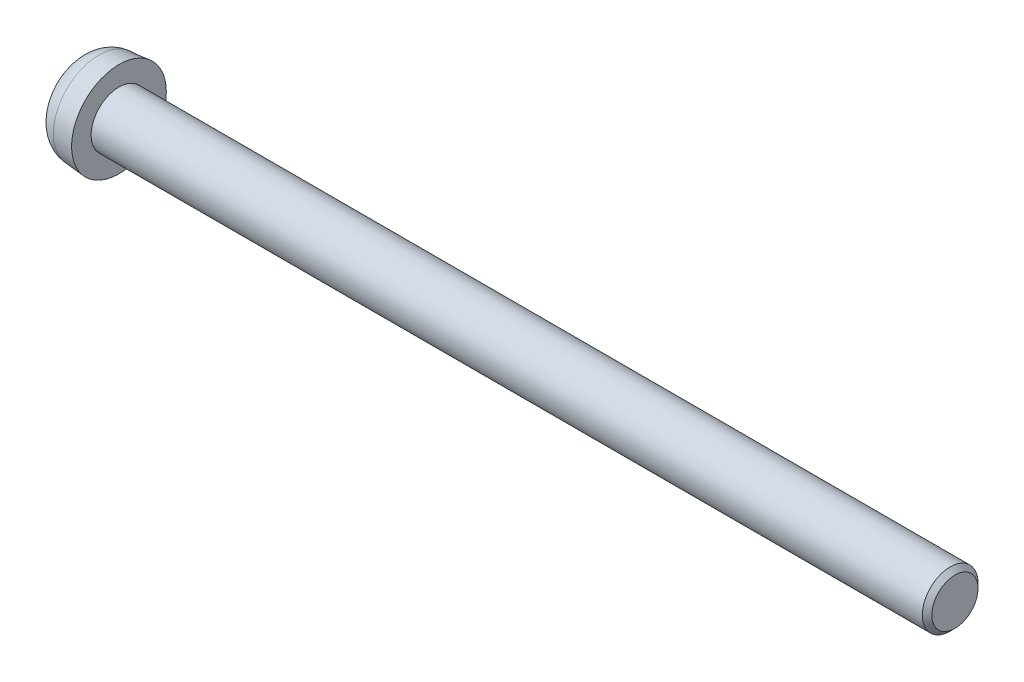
ISO-10303-21;
HEADER;
FILE_DESCRIPTION(('STEP AP214'),'2;1');
FILE_NAME('part.step','',(''),(''),'','','');
FILE_SCHEMA(('AUTOMOTIVE_DESIGN { 1 0 10303 214 1 1 1 1 }'));
ENDSEC;
DATA;
#1=APPLICATION_CONTEXT('core data for automotive mechanical design processes');
#2=APPLICATION_PROTOCOL_DEFINITION('international standard','automotive_design',2000,#1);
#3=PRODUCT_CONTEXT('',#1,'mechanical');
#4=PRODUCT('Part','Part','',(#3));
#5=PRODUCT_RELATED_PRODUCT_CATEGORY('part','',(#4));
#6=PRODUCT_DEFINITION_FORMATION('','',#4);
#7=PRODUCT_DEFINITION_CONTEXT('part definition',#1,'design');
#8=PRODUCT_DEFINITION('design','',#6,#7);
#9=PRODUCT_DEFINITION_SHAPE('','',#8);
#10=(LENGTH_UNIT() NAMED_UNIT(*) SI_UNIT(.MILLI.,.METRE.));
#11=(NAMED_UNIT(*) PLANE_ANGLE_UNIT() SI_UNIT($,.RADIAN.));
#12=(NAMED_UNIT(*) SI_UNIT($,.STERADIAN.) SOLID_ANGLE_UNIT());
#13=UNCERTAINTY_MEASURE_WITH_UNIT(LENGTH_MEASURE(1.E-05),#10,'distance_accuracy_value','');
#14=(GEOMETRIC_REPRESENTATION_CONTEXT(3) GLOBAL_UNCERTAINTY_ASSIGNED_CONTEXT((#13)) GLOBAL_UNIT_ASSIGNED_CONTEXT((#10,
#11,#12)) REPRESENTATION_CONTEXT('',''));
#15=CARTESIAN_POINT('',(0.,0.,0.));
#16=DIRECTION('',(0.,0.,1.));
#17=DIRECTION('',(1.,0.,0.));
#18=AXIS2_PLACEMENT_3D('',#15,#16,#17);
#19=CARTESIAN_POINT('',(-1.397478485,0.,-1.120322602));
#20=CARTESIAN_POINT('',(-1.397478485,2.240645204,-1.120322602));
#21=CARTESIAN_POINT('',(-1.397478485,2.240645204,1.120322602));
#22=CARTESIAN_POINT('',(-1.397478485,0.,1.120322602));
#23=CARTESIAN_POINT('',(-1.492603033,0.,-0.865812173));
#24=CARTESIAN_POINT('',(-1.492603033,1.731624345,-0.865812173));
#25=CARTESIAN_POINT('',(-1.492603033,1.731624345,0.865812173));
#26=CARTESIAN_POINT('',(-1.492603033,0.,0.865812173));
#27=CARTESIAN_POINT('',(-1.554720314,0.,-0.601301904));
#28=CARTESIAN_POINT('',(-1.554720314,1.202603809,-0.601301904));
#29=CARTESIAN_POINT('',(-1.554720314,1.202603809,0.601301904));
#30=CARTESIAN_POINT('',(-1.554720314,0.,0.601301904));
#31=CARTESIAN_POINT('',(-1.582829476,0.,-0.33105366));
#32=CARTESIAN_POINT('',(-1.582829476,0.66210732,-0.33105366));
#33=CARTESIAN_POINT('',(-1.582829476,0.66210732,0.33105366));
#34=CARTESIAN_POINT('',(-1.582829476,0.,0.33105366));
#35=(BOUNDED_SURFACE() B_SPLINE_SURFACE(3,3,((#19,#20,#21,#22),(#23,#24,#25,#26),(#27,#28,#29,
#30),(#31,#32,#33,#34)),.UNSPECIFIED.,.F.,.F.,.F.) B_SPLINE_SURFACE_WITH_KNOTS((4,4),(4,4),(0.,
1.),(0.,1.),.UNSPECIFIED.) GEOMETRIC_REPRESENTATION_ITEM() RATIONAL_B_SPLINE_SURFACE(((1.,
0.333333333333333,0.333333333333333,1.),(0.994629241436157,0.331543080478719,0.331543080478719,
0.994629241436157),(0.994629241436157,0.331543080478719,0.331543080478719,0.994629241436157),
(1.,0.333333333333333,0.333333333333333,1.))) REPRESENTATION_ITEM('') SURFACE());
#36=CARTESIAN_POINT('',(-1.58232422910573,0.2375,0.237499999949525));
#37=CARTESIAN_POINT('',(-1.5732844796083,0.2375,0.35803764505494));
#38=CARTESIAN_POINT('',(-1.55756227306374,0.2375,0.477303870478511));
#39=CARTESIAN_POINT('',(-1.512459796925,0.2375,0.714837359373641));
#40=CARTESIAN_POINT('',(-1.48290351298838,0.2375,0.833071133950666));
#41=CARTESIAN_POINT('',(-1.44648875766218,0.2375,0.949999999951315));
#42=B_SPLINE_CURVE_WITH_KNOTS('',3,(#36,#37,#38,#39,#40,#41),.UNSPECIFIED.,.F.,.F.,(4,2,4),(0.,
0.360894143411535,0.726510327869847),.UNSPECIFIED.);
#43=CARTESIAN_POINT('',(-1.58232422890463,0.2375,0.237499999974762));
#44=VERTEX_POINT('',#43);
#45=CARTESIAN_POINT('',(-1.44648875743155,0.23750000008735,0.95));
#46=VERTEX_POINT('',#45);
#47=EDGE_CURVE('E343',#44,#46,#42,.T.);
#48=CARTESIAN_POINT('',(-1.44648875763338,0.2375000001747,0.95));
#49=CARTESIAN_POINT('',(-1.44956936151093,0.197976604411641,0.950000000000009));
#50=CARTESIAN_POINT('',(-1.45187996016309,0.158423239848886,0.950000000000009));
#51=CARTESIAN_POINT('',(-1.45496114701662,0.0792565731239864,0.949999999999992));
#52=CARTESIAN_POINT('',(-1.45573173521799,0.0396432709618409,0.949999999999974));
#53=CARTESIAN_POINT('',(-1.45573231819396,0.,0.949999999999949));
#54=B_SPLINE_CURVE_WITH_KNOTS('',3,(#48,#49,#50,#51,#52,#53),.UNSPECIFIED.,.F.,.F.,(4,2,4),(0.,
0.118862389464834,0.237724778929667),.UNSPECIFIED.);
#55=CARTESIAN_POINT('',(-1.4557323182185,0.,0.949999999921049));
#56=VERTEX_POINT('',#55);
#57=EDGE_CURVE('E252',#46,#56,#54,.T.);
#58=CARTESIAN_POINT('',(-1.397478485,0.,1.120322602));
#59=CARTESIAN_POINT('',(-1.492603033,0.,0.865812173));
#60=CARTESIAN_POINT('',(-1.554720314,0.,0.601301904));
#61=CARTESIAN_POINT('',(-1.582829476,0.,0.33105366));
#62=(BOUNDED_CURVE() B_SPLINE_CURVE(3,(#58,#59,#60,#61),.UNSPECIFIED.,.F.,
.F.) B_SPLINE_CURVE_WITH_KNOTS((4,4),(0.,1.),
.UNSPECIFIED.) CURVE() GEOMETRIC_REPRESENTATION_ITEM() RATIONAL_B_SPLINE_CURVE((1.,
0.994629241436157,0.994629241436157,1.)) REPRESENTATION_ITEM(''));
#63=CARTESIAN_POINT('',(-1.39747848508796,0.,1.12032260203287));
#64=VERTEX_POINT('',#63);
#65=EDGE_CURVE('E154',#56,#64,#62,.F.);
#66=CARTESIAN_POINT('',(-1.397478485,0.,0.));
#67=DIRECTION('',(1.,0.,0.));
#68=DIRECTION('',(0.,0.,-1.));
#69=AXIS2_PLACEMENT_3D('',#66,#67,#68);
#70=CIRCLE('',#69,1.120322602);
#71=CARTESIAN_POINT('',(-1.39747848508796,0.,-1.12032260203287));
#72=VERTEX_POINT('',#71);
#73=EDGE_CURVE('E249',#72,#64,#70,.T.);
#74=CARTESIAN_POINT('',(-1.397478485,0.,-1.120322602));
#75=CARTESIAN_POINT('',(-1.492603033,0.,-0.865812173));
#76=CARTESIAN_POINT('',(-1.554720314,0.,-0.601301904));
#77=CARTESIAN_POINT('',(-1.582829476,0.,-0.33105366));
#78=(BOUNDED_CURVE() B_SPLINE_CURVE(3,(#74,#75,#76,#77),.UNSPECIFIED.,.F.,
.F.) B_SPLINE_CURVE_WITH_KNOTS((4,4),(0.,1.),
.UNSPECIFIED.) CURVE() GEOMETRIC_REPRESENTATION_ITEM() RATIONAL_B_SPLINE_CURVE((1.,
0.994629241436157,0.994629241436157,1.)) REPRESENTATION_ITEM(''));
#79=CARTESIAN_POINT('',(-1.45573231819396,0.,-0.95));
#80=VERTEX_POINT('',#79);
#81=EDGE_CURVE('E153',#72,#80,#78,.T.);
#82=CARTESIAN_POINT('',(-1.45573231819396,0.,-0.95));
#83=CARTESIAN_POINT('',(-1.45573173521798,0.0396432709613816,-0.950000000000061));
#84=CARTESIAN_POINT('',(-1.45496114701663,0.0792565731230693,-0.950000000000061));
#85=CARTESIAN_POINT('',(-1.45187996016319,0.158423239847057,-0.94999999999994));
#86=CARTESIAN_POINT('',(-1.4495693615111,0.197976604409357,-0.949999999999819));
#87=CARTESIAN_POINT('',(-1.44648875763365,0.237500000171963,-0.949999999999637));
#88=B_SPLINE_CURVE_WITH_KNOTS('',3,(#82,#83,#84,#85,#86,#87),.UNSPECIFIED.,.F.,.F.,(4,2,4),(0.,
0.118862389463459,0.237724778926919),.UNSPECIFIED.);
#89=CARTESIAN_POINT('',(-1.44648875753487,0.2375,-0.949999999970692));
#90=VERTEX_POINT('',#89);
#91=EDGE_CURVE('E21',#80,#90,#88,.T.);
#92=CARTESIAN_POINT('',(-1.44648875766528,0.2375,-0.949999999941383));
#93=CARTESIAN_POINT('',(-1.48243130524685,0.2375,-0.834591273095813));
#94=CARTESIAN_POINT('',(-1.51169233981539,0.2375,-0.717906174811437));
#95=CARTESIAN_POINT('',(-1.55714681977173,0.2375,-0.480439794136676));
#96=CARTESIAN_POINT('',(-1.57316427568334,0.2375,-0.359624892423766));
#97=CARTESIAN_POINT('',(-1.58232422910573,0.2375,-0.237499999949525));
#98=B_SPLINE_CURVE_WITH_KNOTS('',3,(#92,#93,#94,#95,#96,#97),.UNSPECIFIED.,.F.,.F.,(4,2,4),(0.,
0.360894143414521,0.726510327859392),.UNSPECIFIED.);
#99=CARTESIAN_POINT('',(-1.58232422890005,0.237500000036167,-0.2375));
#100=VERTEX_POINT('',#99);
#101=EDGE_CURVE('E133',#90,#100,#98,.T.);
#102=CARTESIAN_POINT('',(-1.58232422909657,0.237500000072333,-0.2375));
#103=CARTESIAN_POINT('',(-1.5732844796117,0.358037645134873,-0.237500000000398));
#104=CARTESIAN_POINT('',(-1.55756227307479,0.477303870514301,-0.237500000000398));
#105=CARTESIAN_POINT('',(-1.51245979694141,0.714837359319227,-0.237499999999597));
#106=CARTESIAN_POINT('',(-1.48290351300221,0.83307113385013,-0.237499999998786));
#107=CARTESIAN_POINT('',(-1.44648875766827,0.949999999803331,-0.237499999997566));
#108=B_SPLINE_CURVE_WITH_KNOTS('',3,(#102,#103,#104,#105,#106,#107),.UNSPECIFIED.,.F.,.F.,(4,2,
4),(0.,0.360894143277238,0.726510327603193),.UNSPECIFIED.);
#109=CARTESIAN_POINT('',(-1.44648875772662,0.95,-0.237500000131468));
#110=VERTEX_POINT('',#109);
#111=EDGE_CURVE('E142',#100,#110,#108,.T.);
#112=CARTESIAN_POINT('',(-1.44648875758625,0.95,-0.237500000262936));
#113=CARTESIAN_POINT('',(-1.45265113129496,0.95,-0.158333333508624));
#114=CARTESIAN_POINT('',(-1.45573231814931,0.95,-0.0791666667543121));
#115=CARTESIAN_POINT('',(-1.45573231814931,0.95,0.079166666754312));
#116=CARTESIAN_POINT('',(-1.45265113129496,0.95,0.158333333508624));
#117=CARTESIAN_POINT('',(-1.44648875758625,0.95,0.237500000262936));
#118=B_SPLINE_CURVE_WITH_KNOTS('',3,(#112,#113,#114,#115,#116,#117),.UNSPECIFIED.,.F.,.F.,(4,2,
4),(0.,0.237679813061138,0.475359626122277),.UNSPECIFIED.);
#119=CARTESIAN_POINT('',(-1.4464887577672,0.949999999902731,0.2375));
#120=VERTEX_POINT('',#119);
#121=EDGE_CURVE('E344',#110,#120,#118,.T.);
#122=CARTESIAN_POINT('',(-1.44648875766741,0.949999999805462,0.2375));
#123=CARTESIAN_POINT('',(-1.48243130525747,0.83459127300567,0.2375));
#124=CARTESIAN_POINT('',(-1.51169233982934,0.717906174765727,0.2375));
#125=CARTESIAN_POINT('',(-1.55714681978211,0.480439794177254,0.2375));
#126=CARTESIAN_POINT('',(-1.57316427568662,0.359624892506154,0.2375));
#127=CARTESIAN_POINT('',(-1.58232422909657,0.237500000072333,0.2375));
#128=B_SPLINE_CURVE_WITH_KNOTS('',3,(#122,#123,#124,#125,#126,#127),.UNSPECIFIED.,.F.,.F.,(4,2,
4),(0.,0.360894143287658,0.726510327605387),.UNSPECIFIED.);
#129=EDGE_CURVE('E336',#120,#44,#128,.T.);
#130=ORIENTED_EDGE('',*,*,#47,.T.);
#131=ORIENTED_EDGE('',*,*,#57,.T.);
#132=ORIENTED_EDGE('',*,*,#65,.T.);
#133=ORIENTED_EDGE('',*,*,#73,.F.);
#134=ORIENTED_EDGE('',*,*,#81,.T.);
#135=ORIENTED_EDGE('',*,*,#91,.T.);
#136=ORIENTED_EDGE('',*,*,#101,.T.);
#137=ORIENTED_EDGE('',*,*,#111,.T.);
#138=ORIENTED_EDGE('',*,*,#121,.T.);
#139=ORIENTED_EDGE('',*,*,#129,.T.);
#140=EDGE_LOOP('',(#130,#131,#132,#133,#134,#135,#136,#137,#138,#139));
#141=FACE_BOUND('',#140,.T.);
#142=ADVANCED_FACE('F17',(#141),#35,.T.);
#143=CARTESIAN_POINT('',(30.,-0.83996,0.83996));
#144=DIRECTION('',(1.,0.,0.));
#145=DIRECTION('',(0.,0.,-1.));
#146=AXIS2_PLACEMENT_3D('',#143,#144,#145);
#147=PLANE('',#146);
#148=CARTESIAN_POINT('',(30.,0.,0.));
#149=DIRECTION('',(-1.,0.,0.));
#150=DIRECTION('',(0.,-1.,0.));
#151=AXIS2_PLACEMENT_3D('',#148,#149,#150);
#152=CIRCLE('',#151,0.829999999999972);
#153=CARTESIAN_POINT('',(30.,-0.829999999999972,0.));
#154=VERTEX_POINT('',#153);
#155=EDGE_CURVE('E243',#154,#154,#152,.F.);
#156=ORIENTED_EDGE('',*,*,#155,.T.);
#157=EDGE_LOOP('',(#156));
#158=FACE_BOUND('',#157,.T.);
#159=ADVANCED_FACE('F277',(#158),#147,.T.);
#160=CARTESIAN_POINT('',(30.,0.,0.));
#161=DIRECTION('',(-1.,0.,0.));
#162=DIRECTION('',(0.,-1.,0.));
#163=AXIS2_PLACEMENT_3D('',#160,#161,#162);
#164=CONICAL_SURFACE('',#163,0.83,0.785398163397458);
#165=CARTESIAN_POINT('',(29.83,0.,0.));
#166=DIRECTION('',(-1.,0.,0.));
#167=DIRECTION('',(0.,0.,1.));
#168=AXIS2_PLACEMENT_3D('',#165,#166,#167);
#169=CIRCLE('',#168,1.);
#170=CARTESIAN_POINT('',(29.83,0.,1.));
#171=VERTEX_POINT('',#170);
#172=EDGE_CURVE('E240',#171,#171,#169,.F.);
#173=ORIENTED_EDGE('',*,*,#172,.T.);
#174=EDGE_LOOP('',(#173));
#175=FACE_BOUND('',#174,.T.);
#176=ORIENTED_EDGE('',*,*,#155,.F.);
#177=EDGE_LOOP('',(#176));
#178=FACE_BOUND('',#177,.T.);
#179=ADVANCED_FACE('F360',(#175,#178),#164,.T.);
#180=CARTESIAN_POINT('',(29.83,0.,0.));
#181=DIRECTION('',(-1.,0.,0.));
#182=DIRECTION('',(0.,0.,1.));
#183=AXIS2_PLACEMENT_3D('',#180,#181,#182);
#184=CYLINDRICAL_SURFACE('',#183,1.);
#185=CARTESIAN_POINT('',(0.,0.,0.));
#186=DIRECTION('',(-1.,0.,0.));
#187=DIRECTION('',(0.,0.,1.));
#188=AXIS2_PLACEMENT_3D('',#185,#186,#187);
#189=CIRCLE('',#188,1.);
#190=CARTESIAN_POINT('',(0.,0.,1.));
#191=VERTEX_POINT('',#190);
#192=EDGE_CURVE('E220',#191,#191,#189,.T.);
#193=ORIENTED_EDGE('',*,*,#192,.F.);
#194=EDGE_LOOP('',(#193));
#195=FACE_BOUND('',#194,.T.);
#196=ORIENTED_EDGE('',*,*,#172,.F.);
#197=EDGE_LOOP('',(#196));
#198=FACE_BOUND('',#197,.T.);
#199=ADVANCED_FACE('F450',(#195,#198),#184,.T.);
#200=CARTESIAN_POINT('',(-0.8,-0.2375,0.95));
#201=DIRECTION('',(0.79535595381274,0.,0.606142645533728));
#202=DIRECTION('',(0.606142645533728,0.,-0.79535595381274));
#203=AXIS2_PLACEMENT_3D('',#200,#201,#202);
#204=PLANE('',#203);
#205=DIRECTION('',(0.,-1.,0.));
#206=VECTOR('',#205,1.);
#207=CARTESIAN_POINT('',(-0.257002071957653,0.,0.2375));
#208=LINE('',#207,#206);
#209=CARTESIAN_POINT('',(-0.257002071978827,0.2375,0.2375));
#210=VERTEX_POINT('',#209);
#211=CARTESIAN_POINT('',(-0.25700207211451,-0.2375,0.2375));
#212=VERTEX_POINT('',#211);
#213=EDGE_CURVE('E183',#210,#212,#208,.T.);
#214=ORIENTED_EDGE('',*,*,#213,.T.);
#215=DIRECTION('',(0.606142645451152,0.,-0.795355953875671));
#216=VECTOR('',#215,1.);
#217=CARTESIAN_POINT('',(-0.80000000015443,-0.2375,0.95));
#218=LINE('',#217,#216);
#219=CARTESIAN_POINT('',(-0.800000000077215,-0.2375,0.95));
#220=VERTEX_POINT('',#219);
#221=EDGE_CURVE('E178',#220,#212,#218,.T.);
#222=ORIENTED_EDGE('',*,*,#221,.F.);
#223=DIRECTION('',(0.,1.,0.));
#224=VECTOR('',#223,1.);
#225=CARTESIAN_POINT('',(-0.8,0.,0.95));
#226=LINE('',#225,#224);
#227=CARTESIAN_POINT('',(-0.8,0.2375,0.95));
#228=VERTEX_POINT('',#227);
#229=EDGE_CURVE('E179',#220,#228,#226,.T.);
#230=ORIENTED_EDGE('',*,*,#229,.T.);
#231=DIRECTION('',(0.606142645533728,0.,-0.79535595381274));
#232=VECTOR('',#231,1.);
#233=CARTESIAN_POINT('',(-0.8,0.2375,0.95));
#234=LINE('',#233,#232);
#235=EDGE_CURVE('E147',#228,#210,#234,.T.);
#236=ORIENTED_EDGE('',*,*,#235,.T.);
#237=EDGE_LOOP('',(#214,#222,#230,#236));
#238=FACE_BOUND('',#237,.T.);
#239=ADVANCED_FACE('F456',(#238),#204,.F.);
#240=CARTESIAN_POINT('',(-1.590276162,0.2375,0.2375));
#241=DIRECTION('',(0.,1.,0.));
#242=DIRECTION('',(0.,0.,1.));
#243=AXIS2_PLACEMENT_3D('',#240,#241,#242);
#244=PLANE('',#243);
#245=ORIENTED_EDGE('',*,*,#47,.F.);
#246=DIRECTION('',(1.,0.,0.));
#247=VECTOR('',#246,1.);
#248=CARTESIAN_POINT('',(-0.9209131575,0.2375,0.2375));
#249=LINE('',#248,#247);
#250=EDGE_CURVE('E184',#44,#210,#249,.T.);
#251=ORIENTED_EDGE('',*,*,#250,.T.);
#252=ORIENTED_EDGE('',*,*,#235,.F.);
#253=DIRECTION('',(-1.,0.,0.));
#254=VECTOR('',#253,1.);
#255=CARTESIAN_POINT('',(-1.129833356,0.2375,0.95));
#256=LINE('',#255,#254);
#257=EDGE_CURVE('E175',#228,#46,#256,.T.);
#258=ORIENTED_EDGE('',*,*,#257,.T.);
#259=EDGE_LOOP('',(#245,#251,#252,#258));
#260=FACE_BOUND('',#259,.T.);
#261=ADVANCED_FACE('F387',(#260),#244,.F.);
#262=CARTESIAN_POINT('',(-1.590276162,0.2375,-0.95));
#263=DIRECTION('',(0.,1.,0.));
#264=DIRECTION('',(0.,0.,1.));
#265=AXIS2_PLACEMENT_3D('',#262,#263,#264);
#266=PLANE('',#265);
#267=DIRECTION('',(0.606142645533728,0.,0.79535595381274));
#268=VECTOR('',#267,1.);
#269=CARTESIAN_POINT('',(-0.528501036,0.2375,-0.59375));
#270=LINE('',#269,#268);
#271=CARTESIAN_POINT('',(-0.800000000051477,0.2375,-0.95));
#272=VERTEX_POINT('',#271);
#273=CARTESIAN_POINT('',(-0.257002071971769,0.2375,-0.2375));
#274=VERTEX_POINT('',#273);
#275=EDGE_CURVE('E218',#272,#274,#270,.T.);
#276=ORIENTED_EDGE('',*,*,#275,.T.);
#277=DIRECTION('',(1.,0.,0.));
#278=VECTOR('',#277,1.);
#279=CARTESIAN_POINT('',(-0.9209131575,0.2375,-0.2375));
#280=LINE('',#279,#278);
#281=EDGE_CURVE('E139',#100,#274,#280,.T.);
#282=ORIENTED_EDGE('',*,*,#281,.F.);
#283=ORIENTED_EDGE('',*,*,#101,.F.);
#284=DIRECTION('',(-1.,0.,0.));
#285=VECTOR('',#284,1.);
#286=CARTESIAN_POINT('',(-0.9196631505,0.2375,-0.95));
#287=LINE('',#286,#285);
#288=EDGE_CURVE('E136',#272,#90,#287,.T.);
#289=ORIENTED_EDGE('',*,*,#288,.F.);
#290=EDGE_LOOP('',(#276,#282,#283,#289));
#291=FACE_BOUND('',#290,.T.);
#292=ADVANCED_FACE('F135',(#291),#266,.F.);
#293=CARTESIAN_POINT('',(-0.8,-0.95,-0.2375));
#294=DIRECTION('',(0.792405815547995,-0.609994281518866,0.));
#295=DIRECTION('',(0.609994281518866,0.792405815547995,0.));
#296=AXIS2_PLACEMENT_3D('',#293,#294,#295);
#297=PLANE('',#296);
#298=DIRECTION('',(0.,0.,-1.));
#299=VECTOR('',#298,1.);
#300=CARTESIAN_POINT('',(-0.251517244,-0.2375,0.));
#301=LINE('',#300,#299);
#302=CARTESIAN_POINT('',(-0.251517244,-0.2375,0.2375));
#303=VERTEX_POINT('',#302);
#304=CARTESIAN_POINT('',(-0.251517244,-0.2375,-0.2375));
#305=VERTEX_POINT('',#304);
#306=EDGE_CURVE('E146',#303,#305,#301,.T.);
#307=ORIENTED_EDGE('',*,*,#306,.T.);
#308=DIRECTION('',(0.609994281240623,0.792405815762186,0.));
#309=VECTOR('',#308,1.);
#310=CARTESIAN_POINT('',(-0.799999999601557,-0.95,-0.2375));
#311=LINE('',#310,#309);
#312=CARTESIAN_POINT('',(-0.799999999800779,-0.95,-0.2375));
#313=VERTEX_POINT('',#312);
#314=EDGE_CURVE('E205',#313,#305,#311,.T.);
#315=ORIENTED_EDGE('',*,*,#314,.F.);
#316=DIRECTION('',(0.,0.,1.));
#317=VECTOR('',#316,1.);
#318=CARTESIAN_POINT('',(-0.8,-0.95,0.));
#319=LINE('',#318,#317);
#320=CARTESIAN_POINT('',(-0.8,-0.95,0.2375));
#321=VERTEX_POINT('',#320);
#322=EDGE_CURVE('E196',#313,#321,#319,.T.);
#323=ORIENTED_EDGE('',*,*,#322,.T.);
#324=DIRECTION('',(0.609994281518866,0.792405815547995,0.));
#325=VECTOR('',#324,1.);
#326=CARTESIAN_POINT('',(-0.8,-0.95,0.2375));
#327=LINE('',#326,#325);
#328=EDGE_CURVE('E194',#321,#303,#327,.T.);
#329=ORIENTED_EDGE('',*,*,#328,.T.);
#330=EDGE_LOOP('',(#307,#315,#323,#329));
#331=FACE_BOUND('',#330,.T.);
#332=ADVANCED_FACE('F386',(#331),#297,.F.);
#333=CARTESIAN_POINT('',(-0.251517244,-0.2375,0.2375));
#334=DIRECTION('',(1.,0.,0.));
#335=DIRECTION('',(0.,0.,-1.));
#336=AXIS2_PLACEMENT_3D('',#333,#334,#335);
#337=PLANE('',#336);
#338=DIRECTION('',(0.,0.,-1.));
#339=VECTOR('',#338,1.);
#340=CARTESIAN_POINT('',(-0.251517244,0.2375,0.));
#341=LINE('',#340,#339);
#342=CARTESIAN_POINT('',(-0.251517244,0.2375,0.2375));
#343=VERTEX_POINT('',#342);
#344=CARTESIAN_POINT('',(-0.251517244,0.2375,-0.2375));
#345=VERTEX_POINT('',#344);
#346=EDGE_CURVE('E228',#343,#345,#341,.T.);
#347=ORIENTED_EDGE('',*,*,#346,.T.);
#348=DIRECTION('',(0.,1.,0.));
#349=VECTOR('',#348,1.);
#350=CARTESIAN_POINT('',(-0.251517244,0.,-0.2375));
#351=LINE('',#350,#349);
#352=EDGE_CURVE('E230',#305,#345,#351,.T.);
#353=ORIENTED_EDGE('',*,*,#352,.F.);
#354=ORIENTED_EDGE('',*,*,#306,.F.);
#355=DIRECTION('',(0.,1.,0.));
#356=VECTOR('',#355,1.);
#357=CARTESIAN_POINT('',(-0.251517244,0.,0.2375));
#358=LINE('',#357,#356);
#359=EDGE_CURVE('E237',#303,#343,#358,.T.);
#360=ORIENTED_EDGE('',*,*,#359,.T.);
#361=EDGE_LOOP('',(#347,#353,#354,#360));
#362=FACE_BOUND('',#361,.T.);
#363=ADVANCED_FACE('F391',(#362),#337,.F.);
#364=CARTESIAN_POINT('',(-0.251517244,0.2375,-0.2375));
#365=DIRECTION('',(0.792405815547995,0.609994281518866,0.));
#366=DIRECTION('',(-0.609994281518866,0.792405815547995,0.));
#367=AXIS2_PLACEMENT_3D('',#364,#365,#366);
#368=PLANE('',#367);
#369=DIRECTION('',(0.,0.,-1.));
#370=VECTOR('',#369,1.);
#371=CARTESIAN_POINT('',(-0.8,0.95,0.));
#372=LINE('',#371,#370);
#373=CARTESIAN_POINT('',(-0.8,0.95,0.2375));
#374=VERTEX_POINT('',#373);
#375=CARTESIAN_POINT('',(-0.799999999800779,0.95,-0.2375));
#376=VERTEX_POINT('',#375);
#377=EDGE_CURVE('E221',#374,#376,#372,.T.);
#378=ORIENTED_EDGE('',*,*,#377,.T.);
#379=DIRECTION('',(-0.609994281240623,0.792405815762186,0.));
#380=VECTOR('',#379,1.);
#381=CARTESIAN_POINT('',(-0.251517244,0.2375,-0.2375));
#382=LINE('',#381,#380);
#383=EDGE_CURVE('E201',#345,#376,#382,.T.);
#384=ORIENTED_EDGE('',*,*,#383,.F.);
#385=ORIENTED_EDGE('',*,*,#346,.F.);
#386=DIRECTION('',(-0.609994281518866,0.792405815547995,0.));
#387=VECTOR('',#386,1.);
#388=CARTESIAN_POINT('',(-0.251517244,0.2375,0.2375));
#389=LINE('',#388,#387);
#390=EDGE_CURVE('E191',#343,#374,#389,.T.);
#391=ORIENTED_EDGE('',*,*,#390,.T.);
#392=EDGE_LOOP('',(#378,#384,#385,#391));
#393=FACE_BOUND('',#392,.T.);
#394=ADVANCED_FACE('F395',(#393),#368,.F.);
#395=CARTESIAN_POINT('',(-1.459666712,0.95,-0.2375));
#396=DIRECTION('',(0.,1.,0.));
#397=DIRECTION('',(0.,0.,1.));
#398=AXIS2_PLACEMENT_3D('',#395,#396,#397);
#399=PLANE('',#398);
#400=DIRECTION('',(-1.,0.,0.));
#401=VECTOR('',#400,1.);
#402=CARTESIAN_POINT('',(-0.9209131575,0.95,0.2375));
#403=LINE('',#402,#401);
#404=EDGE_CURVE('E188',#374,#120,#403,.T.);
#405=ORIENTED_EDGE('',*,*,#404,.T.);
#406=ORIENTED_EDGE('',*,*,#121,.F.);
#407=DIRECTION('',(-1.,0.,0.));
#408=VECTOR('',#407,1.);
#409=CARTESIAN_POINT('',(-0.9209131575,0.95,-0.2375));
#410=LINE('',#409,#408);
#411=EDGE_CURVE('E197',#376,#110,#410,.T.);
#412=ORIENTED_EDGE('',*,*,#411,.F.);
#413=ORIENTED_EDGE('',*,*,#377,.F.);
#414=EDGE_LOOP('',(#405,#406,#412,#413));
#415=FACE_BOUND('',#414,.T.);
#416=ADVANCED_FACE('F398',(#415),#399,.F.);
#417=CARTESIAN_POINT('',(-0.257002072,-0.2375,-0.2375));
#418=DIRECTION('',(0.79535595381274,0.,-0.606142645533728));
#419=DIRECTION('',(-0.606142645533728,0.,-0.79535595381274));
#420=AXIS2_PLACEMENT_3D('',#417,#418,#419);
#421=PLANE('',#420);
#422=DIRECTION('',(0.,-1.,0.));
#423=VECTOR('',#422,1.);
#424=CARTESIAN_POINT('',(-0.8,0.,-0.95));
#425=LINE('',#424,#423);
#426=CARTESIAN_POINT('',(-0.800000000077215,-0.2375,-0.95));
#427=VERTEX_POINT('',#426);
#428=EDGE_CURVE('E145',#272,#427,#425,.T.);
#429=ORIENTED_EDGE('',*,*,#428,.T.);
#430=DIRECTION('',(-0.606142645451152,0.,-0.795355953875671));
#431=VECTOR('',#430,1.);
#432=CARTESIAN_POINT('',(-0.257002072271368,-0.2375,-0.2375));
#433=LINE('',#432,#431);
#434=CARTESIAN_POINT('',(-0.257002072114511,-0.2375,-0.2375));
#435=VERTEX_POINT('',#434);
#436=EDGE_CURVE('E212',#435,#427,#433,.T.);
#437=ORIENTED_EDGE('',*,*,#436,.F.);
#438=DIRECTION('',(0.,-1.,0.));
#439=VECTOR('',#438,1.);
#440=CARTESIAN_POINT('',(-0.257002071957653,0.,-0.2375));
#441=LINE('',#440,#439);
#442=EDGE_CURVE('E206',#274,#435,#441,.T.);
#443=ORIENTED_EDGE('',*,*,#442,.F.);
#444=ORIENTED_EDGE('',*,*,#275,.F.);
#445=EDGE_LOOP('',(#429,#437,#443,#444));
#446=FACE_BOUND('',#445,.T.);
#447=ADVANCED_FACE('F403',(#446),#421,.F.);
#448=CARTESIAN_POINT('',(0.,-1.7204,1.7204));
#449=DIRECTION('',(1.,0.,0.));
#450=DIRECTION('',(0.,0.,-1.));
#451=AXIS2_PLACEMENT_3D('',#448,#449,#450);
#452=PLANE('',#451);
#453=ORIENTED_EDGE('',*,*,#192,.T.);
#454=EDGE_LOOP('',(#453));
#455=FACE_BOUND('',#454,.T.);
#456=CARTESIAN_POINT('',(0.,0.,0.));
#457=DIRECTION('',(1.,0.,0.));
#458=DIRECTION('',(0.,0.,-1.));
#459=AXIS2_PLACEMENT_3D('',#456,#457,#458);
#460=CIRCLE('',#459,1.7);
#461=CARTESIAN_POINT('',(0.,0.,-1.7));
#462=VERTEX_POINT('',#461);
#463=EDGE_CURVE('E214',#462,#462,#460,.T.);
#464=ORIENTED_EDGE('',*,*,#463,.T.);
#465=EDGE_LOOP('',(#464));
#466=FACE_BOUND('',#465,.T.);
#467=ADVANCED_FACE('F406',(#455,#466),#452,.T.);
#468=CARTESIAN_POINT('',(-1.459666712,-0.2375,0.95));
#469=DIRECTION('',(0.,0.,1.));
#470=DIRECTION('',(1.,0.,0.));
#471=AXIS2_PLACEMENT_3D('',#468,#469,#470);
#472=PLANE('',#471);
#473=ORIENTED_EDGE('',*,*,#257,.F.);
#474=ORIENTED_EDGE('',*,*,#229,.F.);
#475=DIRECTION('',(1.,0.,0.));
#476=VECTOR('',#475,1.);
#477=CARTESIAN_POINT('',(-0.9196631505,-0.2375,0.95));
#478=LINE('',#477,#476);
#479=CARTESIAN_POINT('',(-1.44648875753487,-0.2375,0.949999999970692));
#480=VERTEX_POINT('',#479);
#481=EDGE_CURVE('E180',#480,#220,#478,.T.);
#482=ORIENTED_EDGE('',*,*,#481,.F.);
#483=CARTESIAN_POINT('',(-1.45573231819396,0.,0.95));
#484=CARTESIAN_POINT('',(-1.45573173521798,-0.0396432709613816,0.95000000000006));
#485=CARTESIAN_POINT('',(-1.45496114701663,-0.0792565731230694,0.95000000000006));
#486=CARTESIAN_POINT('',(-1.45187996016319,-0.158423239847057,0.94999999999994));
#487=CARTESIAN_POINT('',(-1.4495693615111,-0.197976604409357,0.949999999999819));
#488=CARTESIAN_POINT('',(-1.44648875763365,-0.237500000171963,0.949999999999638));
#489=B_SPLINE_CURVE_WITH_KNOTS('',3,(#483,#484,#485,#486,#487,#488),.UNSPECIFIED.,.F.,.F.,(4,2,
4),(0.,0.118862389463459,0.237724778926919),.UNSPECIFIED.);
#490=EDGE_CURVE('E315',#56,#480,#489,.T.);
#491=ORIENTED_EDGE('',*,*,#490,.F.);
#492=ORIENTED_EDGE('',*,*,#57,.F.);
#493=EDGE_LOOP('',(#473,#474,#482,#491,#492));
#494=FACE_BOUND('',#493,.T.);
#495=ADVANCED_FACE('F325',(#494),#472,.F.);
#496=CARTESIAN_POINT('',(-1.590276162,-0.2375,0.2375));
#497=DIRECTION('',(0.,1.,0.));
#498=DIRECTION('',(0.,0.,1.));
#499=AXIS2_PLACEMENT_3D('',#496,#497,#498);
#500=PLANE('',#499);
#501=CARTESIAN_POINT('',(-1.44648875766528,-0.2375,0.949999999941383));
#502=CARTESIAN_POINT('',(-1.48243130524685,-0.2375,0.834591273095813));
#503=CARTESIAN_POINT('',(-1.51169233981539,-0.2375,0.717906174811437));
#504=CARTESIAN_POINT('',(-1.55714681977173,-0.2375,0.480439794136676));
#505=CARTESIAN_POINT('',(-1.57316427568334,-0.2375,0.359624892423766));
#506=CARTESIAN_POINT('',(-1.58232422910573,-0.2375,0.237499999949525));
#507=B_SPLINE_CURVE_WITH_KNOTS('',3,(#501,#502,#503,#504,#505,#506),.UNSPECIFIED.,.F.,.F.,(4,2,
4),(0.,0.360894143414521,0.726510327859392),.UNSPECIFIED.);
#508=CARTESIAN_POINT('',(-1.58232422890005,-0.237500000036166,0.2375));
#509=VERTEX_POINT('',#508);
#510=EDGE_CURVE('E309',#480,#509,#507,.T.);
#511=ORIENTED_EDGE('',*,*,#510,.F.);
#512=ORIENTED_EDGE('',*,*,#481,.T.);
#513=ORIENTED_EDGE('',*,*,#221,.T.);
#514=DIRECTION('',(-1.,0.,0.));
#515=VECTOR('',#514,1.);
#516=CARTESIAN_POINT('',(-0.9209131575,-0.2375,0.2375));
#517=LINE('',#516,#515);
#518=EDGE_CURVE('E192',#212,#509,#517,.T.);
#519=ORIENTED_EDGE('',*,*,#518,.T.);
#520=EDGE_LOOP('',(#511,#512,#513,#519));
#521=FACE_BOUND('',#520,.T.);
#522=ADVANCED_FACE('F321',(#521),#500,.T.);
#523=CARTESIAN_POINT('',(-1.590309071,-0.95,0.2375));
#524=DIRECTION('',(0.,0.,1.));
#525=DIRECTION('',(1.,0.,0.));
#526=AXIS2_PLACEMENT_3D('',#523,#524,#525);
#527=PLANE('',#526);
#528=ORIENTED_EDGE('',*,*,#129,.F.);
#529=ORIENTED_EDGE('',*,*,#404,.F.);
#530=ORIENTED_EDGE('',*,*,#390,.F.);
#531=ORIENTED_EDGE('',*,*,#359,.F.);
#532=ORIENTED_EDGE('',*,*,#328,.F.);
#533=DIRECTION('',(-1.,0.,0.));
#534=VECTOR('',#533,1.);
#535=CARTESIAN_POINT('',(-1.129833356,-0.95,0.2375));
#536=LINE('',#535,#534);
#537=CARTESIAN_POINT('',(-1.4464887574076,-0.95,0.237500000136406));
#538=VERTEX_POINT('',#537);
#539=EDGE_CURVE('E187',#321,#538,#536,.T.);
#540=ORIENTED_EDGE('',*,*,#539,.T.);
#541=CARTESIAN_POINT('',(-1.58232422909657,-0.237500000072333,0.2375));
#542=CARTESIAN_POINT('',(-1.57328447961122,-0.358037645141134,0.237500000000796));
#543=CARTESIAN_POINT('',(-1.55756227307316,-0.477303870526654,0.237500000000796));
#544=CARTESIAN_POINT('',(-1.51245979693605,-0.714837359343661,0.237499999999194));
#545=CARTESIAN_POINT('',(-1.48290351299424,-0.833071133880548,0.237499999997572));
#546=CARTESIAN_POINT('',(-1.44648875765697,-0.949999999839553,0.237499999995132));
#547=B_SPLINE_CURVE_WITH_KNOTS('',3,(#541,#542,#543,#544,#545,#546),.UNSPECIFIED.,.F.,.F.,(4,2,
4),(0.,0.360894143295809,0.726510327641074),.UNSPECIFIED.);
#548=EDGE_CURVE('E303',#509,#538,#547,.T.);
#549=ORIENTED_EDGE('',*,*,#548,.F.);
#550=ORIENTED_EDGE('',*,*,#518,.F.);
#551=ORIENTED_EDGE('',*,*,#213,.F.);
#552=ORIENTED_EDGE('',*,*,#250,.F.);
#553=EDGE_LOOP('',(#528,#529,#530,#531,#532,#540,#549,#550,#551,#552));
#554=FACE_BOUND('',#553,.T.);
#555=ADVANCED_FACE('F324',(#554),#527,.F.);
#556=CARTESIAN_POINT('',(-1.459666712,-0.95,0.2375));
#557=DIRECTION('',(0.,-1.,0.));
#558=DIRECTION('',(0.,0.,-1.));
#559=AXIS2_PLACEMENT_3D('',#556,#557,#558);
#560=PLANE('',#559);
#561=DIRECTION('',(1.,0.,0.));
#562=VECTOR('',#561,1.);
#563=CARTESIAN_POINT('',(-0.9209131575,-0.95,-0.2375));
#564=LINE('',#563,#562);
#565=CARTESIAN_POINT('',(-1.4464887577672,-0.949999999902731,-0.2375));
#566=VERTEX_POINT('',#565);
#567=EDGE_CURVE('E202',#566,#313,#564,.T.);
#568=ORIENTED_EDGE('',*,*,#567,.F.);
#569=CARTESIAN_POINT('',(-1.44648875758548,-0.95,0.237500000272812));
#570=CARTESIAN_POINT('',(-1.45265113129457,-0.95,0.158333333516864));
#571=CARTESIAN_POINT('',(-1.45573231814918,-0.95,0.079166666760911));
#572=CARTESIAN_POINT('',(-1.45573231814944,-0.95,-0.079166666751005));
#573=CARTESIAN_POINT('',(-1.45265113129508,-0.95,-0.158333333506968));
#574=CARTESIAN_POINT('',(-1.44648875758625,-0.95,-0.237500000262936));
#575=B_SPLINE_CURVE_WITH_KNOTS('',3,(#569,#570,#571,#572,#573,#574),.UNSPECIFIED.,.F.,.F.,(4,2,
4),(0.,0.237679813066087,0.475359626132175),.UNSPECIFIED.);
#576=EDGE_CURVE('E297',#538,#566,#575,.T.);
#577=ORIENTED_EDGE('',*,*,#576,.F.);
#578=ORIENTED_EDGE('',*,*,#539,.F.);
#579=ORIENTED_EDGE('',*,*,#322,.F.);
#580=EDGE_LOOP('',(#568,#577,#578,#579));
#581=FACE_BOUND('',#580,.T.);
#582=ADVANCED_FACE('F331',(#581),#560,.F.);
#583=CARTESIAN_POINT('',(-1.590309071,-0.95,-0.2375));
#584=DIRECTION('',(0.,0.,1.));
#585=DIRECTION('',(1.,0.,0.));
#586=AXIS2_PLACEMENT_3D('',#583,#584,#585);
#587=PLANE('',#586);
#588=ORIENTED_EDGE('',*,*,#383,.T.);
#589=ORIENTED_EDGE('',*,*,#411,.T.);
#590=ORIENTED_EDGE('',*,*,#111,.F.);
#591=ORIENTED_EDGE('',*,*,#281,.T.);
#592=ORIENTED_EDGE('',*,*,#442,.T.);
#593=DIRECTION('',(1.,0.,0.));
#594=VECTOR('',#593,1.);
#595=CARTESIAN_POINT('',(-0.9196631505,-0.2375,-0.2375));
#596=LINE('',#595,#594);
#597=CARTESIAN_POINT('',(-1.5823242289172,-0.2375,-0.237499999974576));
#598=VERTEX_POINT('',#597);
#599=EDGE_CURVE('E200',#598,#435,#596,.T.);
#600=ORIENTED_EDGE('',*,*,#599,.F.);
#601=CARTESIAN_POINT('',(-1.44648875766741,-0.949999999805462,-0.2375));
#602=CARTESIAN_POINT('',(-1.48243130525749,-0.834591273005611,-0.2375));
#603=CARTESIAN_POINT('',(-1.51169233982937,-0.717906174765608,-0.2375));
#604=CARTESIAN_POINT('',(-1.55714681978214,-0.480439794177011,-0.2375));
#605=CARTESIAN_POINT('',(-1.57316427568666,-0.359624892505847,-0.2375));
#606=CARTESIAN_POINT('',(-1.58232422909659,-0.23750000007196,-0.2375));
#607=B_SPLINE_CURVE_WITH_KNOTS('',3,(#601,#602,#603,#604,#605,#606),.UNSPECIFIED.,.F.,.F.,(4,2,
4),(0.,0.360894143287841,0.72651032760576),.UNSPECIFIED.);
#608=EDGE_CURVE('E290',#566,#598,#607,.T.);
#609=ORIENTED_EDGE('',*,*,#608,.F.);
#610=ORIENTED_EDGE('',*,*,#567,.T.);
#611=ORIENTED_EDGE('',*,*,#314,.T.);
#612=ORIENTED_EDGE('',*,*,#352,.T.);
#613=EDGE_LOOP('',(#588,#589,#590,#591,#592,#600,#609,#610,#611,#612));
#614=FACE_BOUND('',#613,.T.);
#615=ADVANCED_FACE('F488',(#614),#587,.T.);
#616=CARTESIAN_POINT('',(-1.590276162,-0.2375,-0.95));
#617=DIRECTION('',(0.,1.,0.));
#618=DIRECTION('',(0.,0.,1.));
#619=AXIS2_PLACEMENT_3D('',#616,#617,#618);
#620=PLANE('',#619);
#621=ORIENTED_EDGE('',*,*,#436,.T.);
#622=DIRECTION('',(-1.,0.,0.));
#623=VECTOR('',#622,1.);
#624=CARTESIAN_POINT('',(-1.129833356,-0.2375,-0.95));
#625=LINE('',#624,#623);
#626=CARTESIAN_POINT('',(-1.44648875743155,-0.23750000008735,-0.95));
#627=VERTEX_POINT('',#626);
#628=EDGE_CURVE('E40',#427,#627,#625,.T.);
#629=ORIENTED_EDGE('',*,*,#628,.T.);
#630=CARTESIAN_POINT('',(-1.58232422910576,-0.2375,-0.237499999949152));
#631=CARTESIAN_POINT('',(-1.57328447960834,-0.2375,-0.35803764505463));
#632=CARTESIAN_POINT('',(-1.55756227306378,-0.2375,-0.477303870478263));
#633=CARTESIAN_POINT('',(-1.51245979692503,-0.2375,-0.714837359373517));
#634=CARTESIAN_POINT('',(-1.4829035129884,-0.2375,-0.833071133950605));
#635=CARTESIAN_POINT('',(-1.44648875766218,-0.2375,-0.949999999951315));
#636=B_SPLINE_CURVE_WITH_KNOTS('',3,(#630,#631,#632,#633,#634,#635),.UNSPECIFIED.,.F.,.F.,(4,2,
4),(0.,0.360894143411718,0.72651032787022),.UNSPECIFIED.);
#637=EDGE_CURVE('E260',#598,#627,#636,.T.);
#638=ORIENTED_EDGE('',*,*,#637,.F.);
#639=ORIENTED_EDGE('',*,*,#599,.T.);
#640=EDGE_LOOP('',(#621,#629,#638,#639));
#641=FACE_BOUND('',#640,.T.);
#642=ADVANCED_FACE('F495',(#641),#620,.T.);
#643=CARTESIAN_POINT('',(-0.8,-0.2375,-0.95));
#644=DIRECTION('',(0.,0.,-1.));
#645=DIRECTION('',(-1.,0.,0.));
#646=AXIS2_PLACEMENT_3D('',#643,#644,#645);
#647=PLANE('',#646);
#648=ORIENTED_EDGE('',*,*,#628,.F.);
#649=ORIENTED_EDGE('',*,*,#428,.F.);
#650=ORIENTED_EDGE('',*,*,#288,.T.);
#651=ORIENTED_EDGE('',*,*,#91,.F.);
#652=CARTESIAN_POINT('',(-1.44648875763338,-0.2375000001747,-0.95));
#653=CARTESIAN_POINT('',(-1.44956936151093,-0.197976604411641,-0.950000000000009));
#654=CARTESIAN_POINT('',(-1.45187996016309,-0.158423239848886,-0.950000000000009));
#655=CARTESIAN_POINT('',(-1.45496114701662,-0.0792565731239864,-0.949999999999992));
#656=CARTESIAN_POINT('',(-1.45573173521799,-0.0396432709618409,-0.949999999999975));
#657=CARTESIAN_POINT('',(-1.45573231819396,0.,-0.949999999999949));
#658=B_SPLINE_CURVE_WITH_KNOTS('',3,(#652,#653,#654,#655,#656,#657),.UNSPECIFIED.,.F.,.F.,(4,2,
4),(0.,0.118862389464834,0.237724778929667),.UNSPECIFIED.);
#659=EDGE_CURVE('E245',#627,#80,#658,.T.);
#660=ORIENTED_EDGE('',*,*,#659,.F.);
#661=EDGE_LOOP('',(#648,#649,#650,#651,#660));
#662=FACE_BOUND('',#661,.T.);
#663=ADVANCED_FACE('F144',(#662),#647,.F.);
#664=CARTESIAN_POINT('',(-0.717833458,0.,0.));
#665=DIRECTION('',(1.,0.,0.));
#666=DIRECTION('',(0.,0.,-1.));
#667=AXIS2_PLACEMENT_3D('',#664,#665,#666);
#668=CONICAL_SURFACE('',#667,1.63719771,0.0872664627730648);
#669=ORIENTED_EDGE('',*,*,#463,.F.);
#670=EDGE_LOOP('',(#669));
#671=FACE_BOUND('',#670,.T.);
#672=CARTESIAN_POINT('',(-0.717833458,0.,0.));
#673=DIRECTION('',(-1.,0.,0.));
#674=DIRECTION('',(0.,0.,1.));
#675=AXIS2_PLACEMENT_3D('',#672,#673,#674);
#676=CIRCLE('',#675,1.63719771);
#677=CARTESIAN_POINT('',(-0.717833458,0.,1.63719771));
#678=VERTEX_POINT('',#677);
#679=EDGE_CURVE('E31',#678,#678,#676,.T.);
#680=ORIENTED_EDGE('',*,*,#679,.F.);
#681=EDGE_LOOP('',(#680));
#682=FACE_BOUND('',#681,.T.);
#683=ADVANCED_FACE('F274',(#671,#682),#668,.T.);
#684=CARTESIAN_POINT('',(-1.397478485,0.,1.120322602));
#685=CARTESIAN_POINT('',(-1.397478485,-2.240645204,1.120322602));
#686=CARTESIAN_POINT('',(-1.397478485,-2.240645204,-1.120322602));
#687=CARTESIAN_POINT('',(-1.397478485,0.,-1.120322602));
#688=CARTESIAN_POINT('',(-1.492603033,0.,0.865812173));
#689=CARTESIAN_POINT('',(-1.492603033,-1.731624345,0.865812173));
#690=CARTESIAN_POINT('',(-1.492603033,-1.731624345,-0.865812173));
#691=CARTESIAN_POINT('',(-1.492603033,0.,-0.865812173));
#692=CARTESIAN_POINT('',(-1.554720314,0.,0.601301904));
#693=CARTESIAN_POINT('',(-1.554720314,-1.202603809,0.601301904));
#694=CARTESIAN_POINT('',(-1.554720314,-1.202603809,-0.601301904));
#695=CARTESIAN_POINT('',(-1.554720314,0.,-0.601301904));
#696=CARTESIAN_POINT('',(-1.582829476,0.,0.33105366));
#697=CARTESIAN_POINT('',(-1.582829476,-0.66210732,0.33105366));
#698=CARTESIAN_POINT('',(-1.582829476,-0.66210732,-0.33105366));
#699=CARTESIAN_POINT('',(-1.582829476,0.,-0.33105366));
#700=(BOUNDED_SURFACE() B_SPLINE_SURFACE(3,3,((#684,#685,#686,#687),(#688,#689,#690,#691),(#692,
#693,#694,#695),(#696,#697,#698,#699)),.UNSPECIFIED.,.F.,.F.,
.F.) B_SPLINE_SURFACE_WITH_KNOTS((4,4),(4,4),(0.,1.),(0.,1.),
.UNSPECIFIED.) GEOMETRIC_REPRESENTATION_ITEM() RATIONAL_B_SPLINE_SURFACE(((1.,0.333333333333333,
0.333333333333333,1.),(0.994629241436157,0.331543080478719,0.331543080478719,0.994629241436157),
(0.994629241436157,0.331543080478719,0.331543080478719,0.994629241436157),(1.,0.333333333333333,
0.333333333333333,1.))) REPRESENTATION_ITEM('') SURFACE());
#701=CARTESIAN_POINT('',(-1.397478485,0.,0.));
#702=DIRECTION('',(1.,0.,0.));
#703=DIRECTION('',(0.,0.,-1.));
#704=AXIS2_PLACEMENT_3D('',#701,#702,#703);
#705=CIRCLE('',#704,1.120322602);
#706=EDGE_CURVE('E11',#64,#72,#705,.T.);
#707=ORIENTED_EDGE('',*,*,#659,.T.);
#708=ORIENTED_EDGE('',*,*,#81,.F.);
#709=ORIENTED_EDGE('',*,*,#706,.F.);
#710=ORIENTED_EDGE('',*,*,#65,.F.);
#711=ORIENTED_EDGE('',*,*,#490,.T.);
#712=ORIENTED_EDGE('',*,*,#510,.T.);
#713=ORIENTED_EDGE('',*,*,#548,.T.);
#714=ORIENTED_EDGE('',*,*,#576,.T.);
#715=ORIENTED_EDGE('',*,*,#608,.T.);
#716=ORIENTED_EDGE('',*,*,#637,.T.);
#717=EDGE_LOOP('',(#707,#708,#709,#710,#711,#712,#713,#714,#715,#716));
#718=FACE_BOUND('',#717,.T.);
#719=ADVANCED_FACE('F267',(#718),#700,.T.);
#720=CARTESIAN_POINT('',(-0.648108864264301,0.,0.));
#721=DIRECTION('',(1.,0.,0.));
#722=DIRECTION('',(0.,0.,-1.));
#723=AXIS2_PLACEMENT_3D('',#720,#721,#722);
#724=TOROIDAL_SURFACE('',#723,0.84024195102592,0.800000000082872);
#725=ORIENTED_EDGE('',*,*,#679,.T.);
#726=EDGE_LOOP('',(#725));
#727=FACE_BOUND('',#726,.T.);
#728=ORIENTED_EDGE('',*,*,#706,.T.);
#729=ORIENTED_EDGE('',*,*,#73,.T.);
#730=EDGE_LOOP('',(#728,#729));
#731=FACE_BOUND('',#730,.T.);
#732=ADVANCED_FACE('F19',(#727,#731),#724,.T.);
#733=CLOSED_SHELL('',(#142,#159,#179,#199,#239,#261,#292,#332,#363,#394,#416,#447,#467,#495,
#522,#555,#582,#615,#642,#663,#683,#719,#732));
#734=MANIFOLD_SOLID_BREP('B1',#733);
#735=ADVANCED_BREP_SHAPE_REPRESENTATION('',(#18,#734),#14);
#736=SHAPE_DEFINITION_REPRESENTATION(#9,#735);
ENDSEC;
END-ISO-10303-21;
